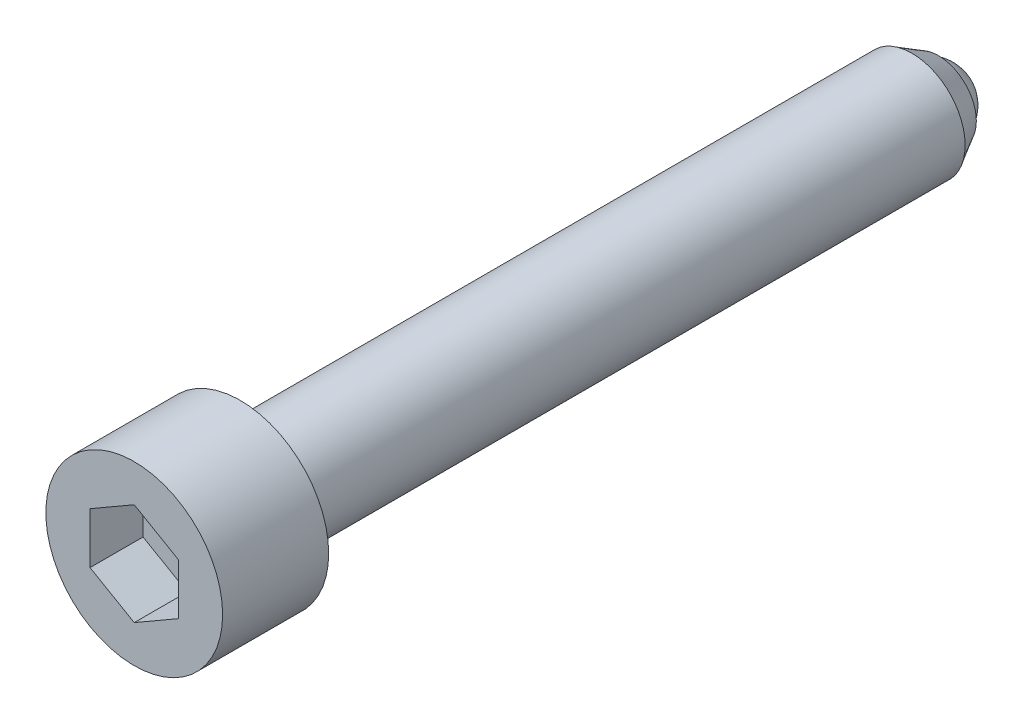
ISO-10303-21;
HEADER;
FILE_DESCRIPTION(('STEP AP214'),'2;1');
FILE_NAME('part.step','',(''),(''),'','','');
FILE_SCHEMA(('AUTOMOTIVE_DESIGN { 1 0 10303 214 1 1 1 1 }'));
ENDSEC;
DATA;
#1=APPLICATION_CONTEXT('core data for automotive mechanical design processes');
#2=APPLICATION_PROTOCOL_DEFINITION('international standard','automotive_design',2000,#1);
#3=PRODUCT_CONTEXT('',#1,'mechanical');
#4=PRODUCT('Part','Part','',(#3));
#5=PRODUCT_RELATED_PRODUCT_CATEGORY('part','',(#4));
#6=PRODUCT_DEFINITION_FORMATION('','',#4);
#7=PRODUCT_DEFINITION_CONTEXT('part definition',#1,'design');
#8=PRODUCT_DEFINITION('design','',#6,#7);
#9=PRODUCT_DEFINITION_SHAPE('','',#8);
#10=(LENGTH_UNIT() NAMED_UNIT(*) SI_UNIT(.MILLI.,.METRE.));
#11=(NAMED_UNIT(*) PLANE_ANGLE_UNIT() SI_UNIT($,.RADIAN.));
#12=(NAMED_UNIT(*) SI_UNIT($,.STERADIAN.) SOLID_ANGLE_UNIT());
#13=UNCERTAINTY_MEASURE_WITH_UNIT(LENGTH_MEASURE(1.E-05),#10,'distance_accuracy_value','');
#14=(GEOMETRIC_REPRESENTATION_CONTEXT(3) GLOBAL_UNCERTAINTY_ASSIGNED_CONTEXT((#13)) GLOBAL_UNIT_ASSIGNED_CONTEXT((#10,
#11,#12)) REPRESENTATION_CONTEXT('',''));
#15=CARTESIAN_POINT('',(0.,0.,0.));
#16=DIRECTION('',(0.,0.,1.));
#17=DIRECTION('',(1.,0.,0.));
#18=AXIS2_PLACEMENT_3D('',#15,#16,#17);
#19=CARTESIAN_POINT('',(0.,0.,2.));
#20=DIRECTION('',(0.,0.,-1.));
#21=DIRECTION('',(1.,0.,0.));
#22=AXIS2_PLACEMENT_3D('',#19,#20,#21);
#23=SPHERICAL_SURFACE('',#22,2.);
#24=CARTESIAN_POINT('',(0.,0.,1.4));
#25=DIRECTION('',(0.,0.,-1.));
#26=DIRECTION('',(1.,0.,0.));
#27=AXIS2_PLACEMENT_3D('',#24,#25,#26);
#28=CIRCLE('',#27,1.90787840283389);
#29=CARTESIAN_POINT('',(1.90787840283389,0.,1.4));
#30=VERTEX_POINT('',#29);
#31=EDGE_CURVE('E9',#30,#30,#28,.T.);
#32=ORIENTED_EDGE('',*,*,#31,.T.);
#33=EDGE_LOOP('',(#32));
#34=FACE_BOUND('',#33,.T.);
#35=ADVANCED_FACE('F15',(#34),#23,.T.);
#36=CARTESIAN_POINT('',(2.13397459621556,0.,1.4));
#37=DIRECTION('',(0.,0.,1.));
#38=DIRECTION('',(-1.,0.,0.));
#39=AXIS2_PLACEMENT_3D('',#36,#37,#38);
#40=PLANE('',#39);
#41=ORIENTED_EDGE('',*,*,#31,.F.);
#42=EDGE_LOOP('',(#41));
#43=FACE_BOUND('',#42,.T.);
#44=CARTESIAN_POINT('',(0.,0.,1.4));
#45=DIRECTION('',(0.,0.,-1.));
#46=DIRECTION('',(1.,0.,0.));
#47=AXIS2_PLACEMENT_3D('',#44,#45,#46);
#48=CIRCLE('',#47,2.13397459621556);
#49=CARTESIAN_POINT('',(2.13397459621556,0.,1.4));
#50=VERTEX_POINT('',#49);
#51=EDGE_CURVE('E22',#50,#50,#48,.T.);
#52=ORIENTED_EDGE('',*,*,#51,.T.);
#53=EDGE_LOOP('',(#52));
#54=FACE_BOUND('',#53,.T.);
#55=ADVANCED_FACE('F136',(#43,#54),#40,.F.);
#56=CARTESIAN_POINT('',(0.,0.,2.9));
#57=DIRECTION('',(0.,0.,1.));
#58=DIRECTION('',(-1.,0.,0.));
#59=AXIS2_PLACEMENT_3D('',#56,#57,#58);
#60=CONICAL_SURFACE('',#59,3.,0.523598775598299);
#61=ORIENTED_EDGE('',*,*,#51,.F.);
#62=EDGE_LOOP('',(#61));
#63=FACE_BOUND('',#62,.T.);
#64=CARTESIAN_POINT('',(0.,0.,2.9));
#65=DIRECTION('',(0.,0.,-1.));
#66=DIRECTION('',(1.,0.,0.));
#67=AXIS2_PLACEMENT_3D('',#64,#65,#66);
#68=CIRCLE('',#67,3.);
#69=CARTESIAN_POINT('',(3.,0.,2.9));
#70=VERTEX_POINT('',#69);
#71=EDGE_CURVE('E131',#70,#70,#68,.T.);
#72=ORIENTED_EDGE('',*,*,#71,.T.);
#73=EDGE_LOOP('',(#72));
#74=FACE_BOUND('',#73,.T.);
#75=ADVANCED_FACE('F138',(#63,#74),#60,.T.);
#76=CARTESIAN_POINT('',(0.,0.,20.9));
#77=DIRECTION('',(0.,0.,-1.));
#78=DIRECTION('',(1.,0.,0.));
#79=AXIS2_PLACEMENT_3D('',#76,#77,#78);
#80=CYLINDRICAL_SURFACE('',#79,3.);
#81=ORIENTED_EDGE('',*,*,#71,.F.);
#82=EDGE_LOOP('',(#81));
#83=FACE_BOUND('',#82,.T.);
#84=CARTESIAN_POINT('',(0.,0.,40.9));
#85=DIRECTION('',(0.,0.,-1.));
#86=DIRECTION('',(1.,0.,0.));
#87=AXIS2_PLACEMENT_3D('',#84,#85,#86);
#88=CIRCLE('',#87,3.);
#89=CARTESIAN_POINT('',(3.,0.,40.9));
#90=VERTEX_POINT('',#89);
#91=EDGE_CURVE('E128',#90,#90,#88,.T.);
#92=ORIENTED_EDGE('',*,*,#91,.T.);
#93=EDGE_LOOP('',(#92));
#94=FACE_BOUND('',#93,.T.);
#95=ADVANCED_FACE('F141',(#83,#94),#80,.T.);
#96=CARTESIAN_POINT('',(3.,0.,40.9));
#97=DIRECTION('',(0.,0.,-1.));
#98=DIRECTION('',(1.,0.,0.));
#99=AXIS2_PLACEMENT_3D('',#96,#97,#98);
#100=PLANE('',#99);
#101=CARTESIAN_POINT('',(0.,0.,40.9));
#102=DIRECTION('',(0.,0.,-1.));
#103=DIRECTION('',(1.,0.,0.));
#104=AXIS2_PLACEMENT_3D('',#101,#102,#103);
#105=CIRCLE('',#104,5.);
#106=CARTESIAN_POINT('',(5.,0.,40.9));
#107=VERTEX_POINT('',#106);
#108=EDGE_CURVE('E125',#107,#107,#105,.T.);
#109=ORIENTED_EDGE('',*,*,#108,.T.);
#110=EDGE_LOOP('',(#109));
#111=FACE_BOUND('',#110,.T.);
#112=ORIENTED_EDGE('',*,*,#91,.F.);
#113=EDGE_LOOP('',(#112));
#114=FACE_BOUND('',#113,.T.);
#115=ADVANCED_FACE('F147',(#111,#114),#100,.T.);
#116=CARTESIAN_POINT('',(0.,0.,20.9));
#117=DIRECTION('',(0.,0.,-1.));
#118=DIRECTION('',(1.,0.,0.));
#119=AXIS2_PLACEMENT_3D('',#116,#117,#118);
#120=CYLINDRICAL_SURFACE('',#119,5.);
#121=CARTESIAN_POINT('',(0.,0.,46.9));
#122=DIRECTION('',(0.,0.,-1.));
#123=DIRECTION('',(1.,0.,0.));
#124=AXIS2_PLACEMENT_3D('',#121,#122,#123);
#125=CIRCLE('',#124,5.);
#126=CARTESIAN_POINT('',(5.,0.,46.9));
#127=VERTEX_POINT('',#126);
#128=EDGE_CURVE('E122',#127,#127,#125,.T.);
#129=ORIENTED_EDGE('',*,*,#128,.T.);
#130=EDGE_LOOP('',(#129));
#131=FACE_BOUND('',#130,.T.);
#132=ORIENTED_EDGE('',*,*,#108,.F.);
#133=EDGE_LOOP('',(#132));
#134=FACE_BOUND('',#133,.T.);
#135=ADVANCED_FACE('F152',(#131,#134),#120,.T.);
#136=CARTESIAN_POINT('',(5.,0.,46.9));
#137=DIRECTION('',(0.,0.,1.));
#138=DIRECTION('',(-1.,0.,0.));
#139=AXIS2_PLACEMENT_3D('',#136,#137,#138);
#140=PLANE('',#139);
#141=DIRECTION('',(-0.86602540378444,0.5,0.));
#142=VECTOR('',#141,1.);
#143=CARTESIAN_POINT('',(2.5,1.44337567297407,46.9));
#144=LINE('',#143,#142);
#145=CARTESIAN_POINT('',(2.5,1.44337567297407,46.9));
#146=VERTEX_POINT('',#145);
#147=CARTESIAN_POINT('',(0.,2.88675134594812,46.9));
#148=VERTEX_POINT('',#147);
#149=EDGE_CURVE('E29',#146,#148,#144,.T.);
#150=ORIENTED_EDGE('',*,*,#149,.F.);
#151=DIRECTION('',(0.,1.,0.));
#152=VECTOR('',#151,1.);
#153=CARTESIAN_POINT('',(2.5,-1.44337567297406,46.9));
#154=LINE('',#153,#152);
#155=CARTESIAN_POINT('',(2.5,-1.44337567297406,46.9));
#156=VERTEX_POINT('',#155);
#157=EDGE_CURVE('E98',#156,#146,#154,.T.);
#158=ORIENTED_EDGE('',*,*,#157,.F.);
#159=DIRECTION('',(-0.866025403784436,-0.5,0.));
#160=VECTOR('',#159,1.);
#161=CARTESIAN_POINT('',(2.5,-1.44337567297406,46.9));
#162=LINE('',#161,#160);
#163=CARTESIAN_POINT('',(0.,-2.88675134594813,46.9));
#164=VERTEX_POINT('',#163);
#165=EDGE_CURVE('E93',#156,#164,#162,.T.);
#166=ORIENTED_EDGE('',*,*,#165,.T.);
#167=DIRECTION('',(0.866025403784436,-0.5,0.));
#168=VECTOR('',#167,1.);
#169=CARTESIAN_POINT('',(-2.5,-1.44337567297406,46.9));
#170=LINE('',#169,#168);
#171=CARTESIAN_POINT('',(-2.5,-1.44337567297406,46.9));
#172=VERTEX_POINT('',#171);
#173=EDGE_CURVE('E91',#172,#164,#170,.T.);
#174=ORIENTED_EDGE('',*,*,#173,.F.);
#175=DIRECTION('',(0.,1.,0.));
#176=VECTOR('',#175,1.);
#177=CARTESIAN_POINT('',(-2.5,-1.44337567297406,46.9));
#178=LINE('',#177,#176);
#179=CARTESIAN_POINT('',(-2.5,1.44337567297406,46.9));
#180=VERTEX_POINT('',#179);
#181=EDGE_CURVE('E72',#172,#180,#178,.T.);
#182=ORIENTED_EDGE('',*,*,#181,.T.);
#183=DIRECTION('',(0.866025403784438,0.5,0.));
#184=VECTOR('',#183,1.);
#185=CARTESIAN_POINT('',(-2.5,1.44337567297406,46.9));
#186=LINE('',#185,#184);
#187=EDGE_CURVE('E83',#180,#148,#186,.T.);
#188=ORIENTED_EDGE('',*,*,#187,.T.);
#189=EDGE_LOOP('',(#150,#158,#166,#174,#182,#188));
#190=FACE_BOUND('',#189,.T.);
#191=ORIENTED_EDGE('',*,*,#128,.F.);
#192=EDGE_LOOP('',(#191));
#193=FACE_BOUND('',#192,.T.);
#194=ADVANCED_FACE('F87',(#190,#193),#140,.T.);
#195=CARTESIAN_POINT('',(2.5,1.44337567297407,43.9));
#196=DIRECTION('',(0.5,0.86602540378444,0.));
#197=DIRECTION('',(0.86602540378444,-0.5,0.));
#198=AXIS2_PLACEMENT_3D('',#195,#196,#197);
#199=PLANE('',#198);
#200=DIRECTION('',(0.,0.,1.));
#201=VECTOR('',#200,1.);
#202=CARTESIAN_POINT('',(2.5,1.44337567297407,43.9));
#203=LINE('',#202,#201);
#204=CARTESIAN_POINT('',(2.5,1.44337567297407,43.9));
#205=VERTEX_POINT('',#204);
#206=EDGE_CURVE('E36',#205,#146,#203,.T.);
#207=ORIENTED_EDGE('',*,*,#206,.T.);
#208=ORIENTED_EDGE('',*,*,#149,.T.);
#209=DIRECTION('',(0.,0.,1.));
#210=VECTOR('',#209,1.);
#211=CARTESIAN_POINT('',(0.,2.88675134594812,43.9));
#212=LINE('',#211,#210);
#213=CARTESIAN_POINT('',(0.,2.88675134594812,43.9));
#214=VERTEX_POINT('',#213);
#215=EDGE_CURVE('E80',#214,#148,#212,.T.);
#216=ORIENTED_EDGE('',*,*,#215,.F.);
#217=DIRECTION('',(-0.86602540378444,0.5,0.));
#218=VECTOR('',#217,1.);
#219=CARTESIAN_POINT('',(2.5,1.44337567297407,43.9));
#220=LINE('',#219,#218);
#221=EDGE_CURVE('E100',#205,#214,#220,.T.);
#222=ORIENTED_EDGE('',*,*,#221,.F.);
#223=EDGE_LOOP('',(#207,#208,#216,#222));
#224=FACE_BOUND('',#223,.T.);
#225=ADVANCED_FACE('F206',(#224),#199,.F.);
#226=CARTESIAN_POINT('',(2.5,-1.44337567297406,43.9));
#227=DIRECTION('',(1.,0.,0.));
#228=DIRECTION('',(0.,0.,1.));
#229=AXIS2_PLACEMENT_3D('',#226,#227,#228);
#230=PLANE('',#229);
#231=DIRECTION('',(0.,0.,1.));
#232=VECTOR('',#231,1.);
#233=CARTESIAN_POINT('',(2.5,-1.44337567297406,43.9));
#234=LINE('',#233,#232);
#235=CARTESIAN_POINT('',(2.5,-1.44337567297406,43.9));
#236=VERTEX_POINT('',#235);
#237=EDGE_CURVE('E119',#236,#156,#234,.T.);
#238=ORIENTED_EDGE('',*,*,#237,.T.);
#239=ORIENTED_EDGE('',*,*,#157,.T.);
#240=ORIENTED_EDGE('',*,*,#206,.F.);
#241=DIRECTION('',(0.,1.,0.));
#242=VECTOR('',#241,1.);
#243=CARTESIAN_POINT('',(2.5,-1.44337567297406,43.9));
#244=LINE('',#243,#242);
#245=EDGE_CURVE('E112',#236,#205,#244,.T.);
#246=ORIENTED_EDGE('',*,*,#245,.F.);
#247=EDGE_LOOP('',(#238,#239,#240,#246));
#248=FACE_BOUND('',#247,.T.);
#249=ADVANCED_FACE('F215',(#248),#230,.F.);
#250=CARTESIAN_POINT('',(2.5,-1.44337567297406,43.9));
#251=DIRECTION('',(-0.5,0.866025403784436,0.));
#252=DIRECTION('',(0.866025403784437,0.5,0.));
#253=AXIS2_PLACEMENT_3D('',#250,#251,#252);
#254=PLANE('',#253);
#255=DIRECTION('',(0.,0.,1.));
#256=VECTOR('',#255,1.);
#257=CARTESIAN_POINT('',(0.,-2.88675134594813,43.9));
#258=LINE('',#257,#256);
#259=CARTESIAN_POINT('',(0.,-2.88675134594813,43.9));
#260=VERTEX_POINT('',#259);
#261=EDGE_CURVE('E117',#260,#164,#258,.T.);
#262=ORIENTED_EDGE('',*,*,#261,.T.);
#263=ORIENTED_EDGE('',*,*,#165,.F.);
#264=ORIENTED_EDGE('',*,*,#237,.F.);
#265=DIRECTION('',(-0.866025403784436,-0.5,0.));
#266=VECTOR('',#265,1.);
#267=CARTESIAN_POINT('',(2.5,-1.44337567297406,43.9));
#268=LINE('',#267,#266);
#269=EDGE_CURVE('E109',#236,#260,#268,.T.);
#270=ORIENTED_EDGE('',*,*,#269,.T.);
#271=EDGE_LOOP('',(#262,#263,#264,#270));
#272=FACE_BOUND('',#271,.T.);
#273=ADVANCED_FACE('F224',(#272),#254,.T.);
#274=CARTESIAN_POINT('',(-2.5,-1.44337567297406,43.9));
#275=DIRECTION('',(-0.5,-0.866025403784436,0.));
#276=DIRECTION('',(-0.866025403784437,0.5,0.));
#277=AXIS2_PLACEMENT_3D('',#274,#275,#276);
#278=PLANE('',#277);
#279=DIRECTION('',(0.,0.,1.));
#280=VECTOR('',#279,1.);
#281=CARTESIAN_POINT('',(-2.5,-1.44337567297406,43.9));
#282=LINE('',#281,#280);
#283=CARTESIAN_POINT('',(-2.5,-1.44337567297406,43.9));
#284=VERTEX_POINT('',#283);
#285=EDGE_CURVE('E79',#284,#172,#282,.T.);
#286=ORIENTED_EDGE('',*,*,#285,.T.);
#287=ORIENTED_EDGE('',*,*,#173,.T.);
#288=ORIENTED_EDGE('',*,*,#261,.F.);
#289=DIRECTION('',(0.866025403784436,-0.5,0.));
#290=VECTOR('',#289,1.);
#291=CARTESIAN_POINT('',(-2.5,-1.44337567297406,43.9));
#292=LINE('',#291,#290);
#293=EDGE_CURVE('E106',#284,#260,#292,.T.);
#294=ORIENTED_EDGE('',*,*,#293,.F.);
#295=EDGE_LOOP('',(#286,#287,#288,#294));
#296=FACE_BOUND('',#295,.T.);
#297=ADVANCED_FACE('F233',(#296),#278,.F.);
#298=CARTESIAN_POINT('',(-2.5,-1.44337567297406,43.9));
#299=DIRECTION('',(1.,0.,0.));
#300=DIRECTION('',(0.,-1.,0.));
#301=AXIS2_PLACEMENT_3D('',#298,#299,#300);
#302=PLANE('',#301);
#303=DIRECTION('',(0.,0.,1.));
#304=VECTOR('',#303,1.);
#305=CARTESIAN_POINT('',(-2.5,1.44337567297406,43.9));
#306=LINE('',#305,#304);
#307=CARTESIAN_POINT('',(-2.5,1.44337567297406,43.9));
#308=VERTEX_POINT('',#307);
#309=EDGE_CURVE('E68',#308,#180,#306,.T.);
#310=ORIENTED_EDGE('',*,*,#309,.T.);
#311=ORIENTED_EDGE('',*,*,#181,.F.);
#312=ORIENTED_EDGE('',*,*,#285,.F.);
#313=DIRECTION('',(0.,1.,0.));
#314=VECTOR('',#313,1.);
#315=CARTESIAN_POINT('',(-2.5,-1.44337567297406,43.9));
#316=LINE('',#315,#314);
#317=EDGE_CURVE('E75',#284,#308,#316,.T.);
#318=ORIENTED_EDGE('',*,*,#317,.T.);
#319=EDGE_LOOP('',(#310,#311,#312,#318));
#320=FACE_BOUND('',#319,.T.);
#321=ADVANCED_FACE('F70',(#320),#302,.T.);
#322=CARTESIAN_POINT('',(-2.5,1.44337567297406,43.9));
#323=DIRECTION('',(0.5,-0.866025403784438,0.));
#324=DIRECTION('',(-0.866025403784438,-0.5,0.));
#325=AXIS2_PLACEMENT_3D('',#322,#323,#324);
#326=PLANE('',#325);
#327=DIRECTION('',(0.866025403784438,0.5,0.));
#328=VECTOR('',#327,1.);
#329=CARTESIAN_POINT('',(-2.5,1.44337567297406,43.9));
#330=LINE('',#329,#328);
#331=EDGE_CURVE('E103',#308,#214,#330,.T.);
#332=ORIENTED_EDGE('',*,*,#331,.T.);
#333=ORIENTED_EDGE('',*,*,#215,.T.);
#334=ORIENTED_EDGE('',*,*,#187,.F.);
#335=ORIENTED_EDGE('',*,*,#309,.F.);
#336=EDGE_LOOP('',(#332,#333,#334,#335));
#337=FACE_BOUND('',#336,.T.);
#338=ADVANCED_FACE('F84',(#337),#326,.T.);
#339=CARTESIAN_POINT('',(2.5,1.44337567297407,43.9));
#340=DIRECTION('',(0.,0.,-1.));
#341=DIRECTION('',(1.,0.,0.));
#342=AXIS2_PLACEMENT_3D('',#339,#340,#341);
#343=PLANE('',#342);
#344=ORIENTED_EDGE('',*,*,#221,.T.);
#345=ORIENTED_EDGE('',*,*,#331,.F.);
#346=ORIENTED_EDGE('',*,*,#317,.F.);
#347=ORIENTED_EDGE('',*,*,#293,.T.);
#348=ORIENTED_EDGE('',*,*,#269,.F.);
#349=ORIENTED_EDGE('',*,*,#245,.T.);
#350=EDGE_LOOP('',(#344,#345,#346,#347,#348,#349));
#351=FACE_BOUND('',#350,.T.);
#352=ADVANCED_FACE('F253',(#351),#343,.F.);
#353=CLOSED_SHELL('',(#35,#55,#75,#95,#115,#135,#194,#225,#249,#273,#297,#321,#338,#352));
#354=MANIFOLD_SOLID_BREP('B1',#353);
#355=ADVANCED_BREP_SHAPE_REPRESENTATION('',(#18,#354),#14);
#356=SHAPE_DEFINITION_REPRESENTATION(#9,#355);
ENDSEC;
END-ISO-10303-21;
